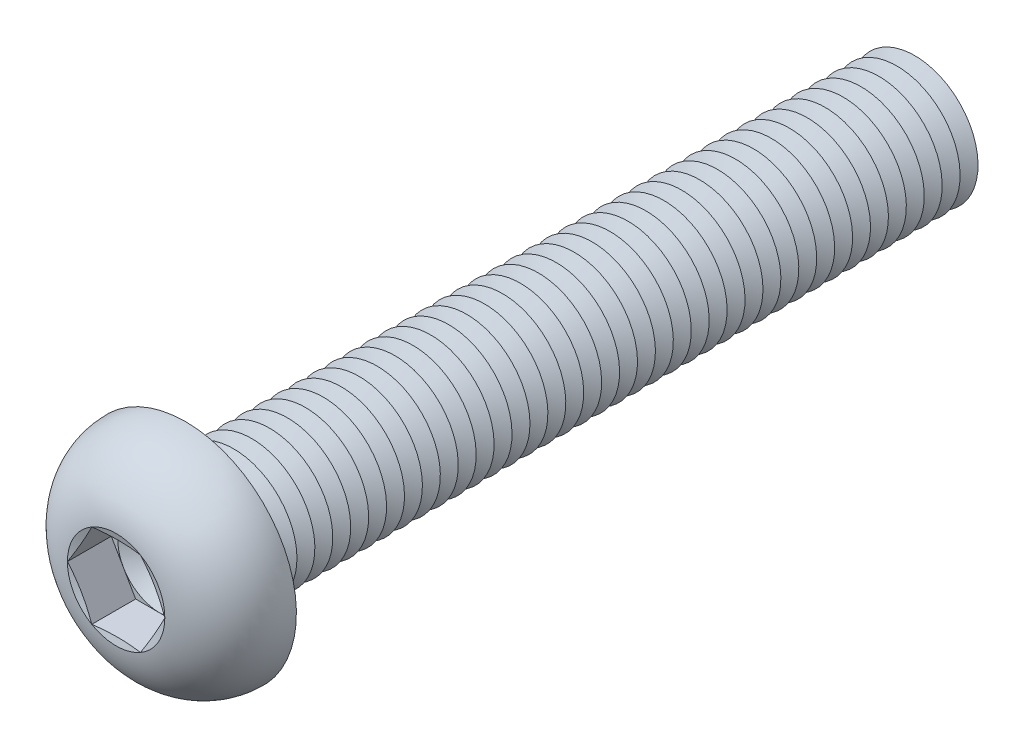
from build123d import *

# Parameters (mm, degrees)
FILLET1_R          = 0.85
LPATTERN1_COUNT    = 41
LPATTERN1_PITCH    = 1.7
CUT_EXTRUDE1_DEPTH = 4.16


with BuildPart() as part:
    # Sketch1 → Revolve1 (revolve)
    with BuildSketch(Plane(origin=(0, 0, 0), x_dir=(0, 0, -1), z_dir=(1, 0, 0))):
        with BuildLine():
            Line((0, 6), (0, 10.5))
            ThreePointArc((0, 10.5), (-4.420082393, 8.816378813), (-6.6, 4.6188))
            Line((-6.6, 4.6188), (-5.981198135, 2.3094))
            Line((-5.981198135, 2.3094), (-6.6, 2.3094))
            Line((-6.6, 2.3094), (-6.6, 0))
            Line((-6.6, 0), (70, 0))
            Line((70, 0), (70, 6))
            Line((70, 6), (0, 6))
        make_face()
    revolve(axis=Axis((0, 0, -70), (0, 0, 1)))

    # Fillet1
    fillet1_edges = [part.edges().sort_by_distance(p)[0] for p in [
        (0, -6, 0),
    ]]
    fillet(fillet1_edges, radius=FILLET1_R)

    # Sketch2 → Cut-Revolve1 (revolve, cut)
    with BuildSketch(Plane(origin=(0, 0, 0), x_dir=(0, 0, -1), z_dir=(1, 0, 0))):
        Polygon((69.15, 6), (70.85, 6), (70, 4.527756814), align=None)
    cut_revolve1 = revolve(axis=Axis((0, 0, -70), (0, 0, -1)), mode=Mode.SUBTRACT)

    # LPattern1: Cut-Revolve1 ×41
    with Locations(*[(0, 0, i * LPATTERN1_PITCH) for i in range(1, LPATTERN1_COUNT)]):
        add(cut_revolve1, mode=Mode.SUBTRACT)

    # Sketch3 → Cut-Extrude1 (cut)
    with BuildSketch(Plane.XY.offset(6.6)):
        Polygon((2.3094, 3.999998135), (-2.3094, 3.999998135), (-4.6188, 0), (-2.3094, -3.999998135), (2.3094, -3.999998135), (4.6188, 0), align=None)
    extrude(amount=-CUT_EXTRUDE1_DEPTH, mode=Mode.SUBTRACT)

    # Cut-Extrude2 cone 1 section (on through the dimple's axis) → Cut-Extrude2 (revolve, cut)
    with BuildSketch(Plane(origin=(0, 0, 2.44), x_dir=(0, -1, 0), z_dir=(1, 0, 0))):
        Polygon((0, 0), (3.999998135, 0), (0, 2.3094), align=None)
    revolve(axis=Axis((0, 0, 2.44), (0, 0, -1)), mode=Mode.SUBTRACT)


solid = part.part
